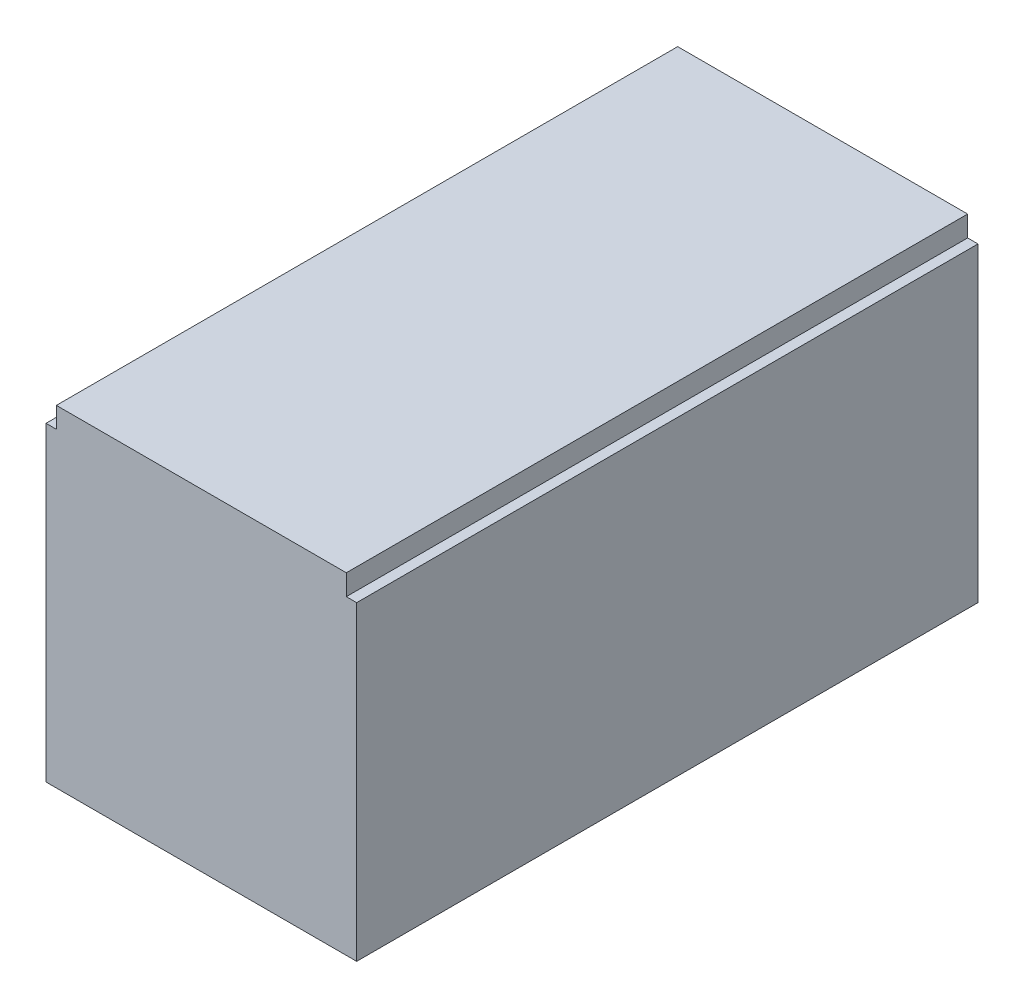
from build123d import *

# Parameters (mm, degrees)
SKETCH1_W      = 7.5
SKETCH1_H      = 15
EXTRUDE1_DEPTH = 8
SKETCH2_W      = 0.25
SKETCH2_H      = 15
EXTRUDE2_DEPTH = 0.5


with BuildPart() as part:
    # Sketch1 → Extrude1 (new body)
    with BuildSketch(Plane(origin=(0, 0, 0), x_dir=(1, 0, 0), z_dir=(0, 1, 0))):
        with Locations((0, 7.5)):
            Rectangle(SKETCH1_W, SKETCH1_H)
    extrude(amount=EXTRUDE1_DEPTH)

    # Sketch2 → Extrude2 (cut)
    with BuildSketch(Plane(origin=(0, 8, 0), x_dir=(-1, 0, 0), z_dir=(0, 1, 0))):
        with Locations((3.625, -7.5)):
            Rectangle(SKETCH2_W, SKETCH2_H)
        with Locations((-3.625, -7.5)):
            Rectangle(SKETCH2_W, SKETCH2_H)
    extrude(amount=-EXTRUDE2_DEPTH, mode=Mode.SUBTRACT)


solid = part.part
